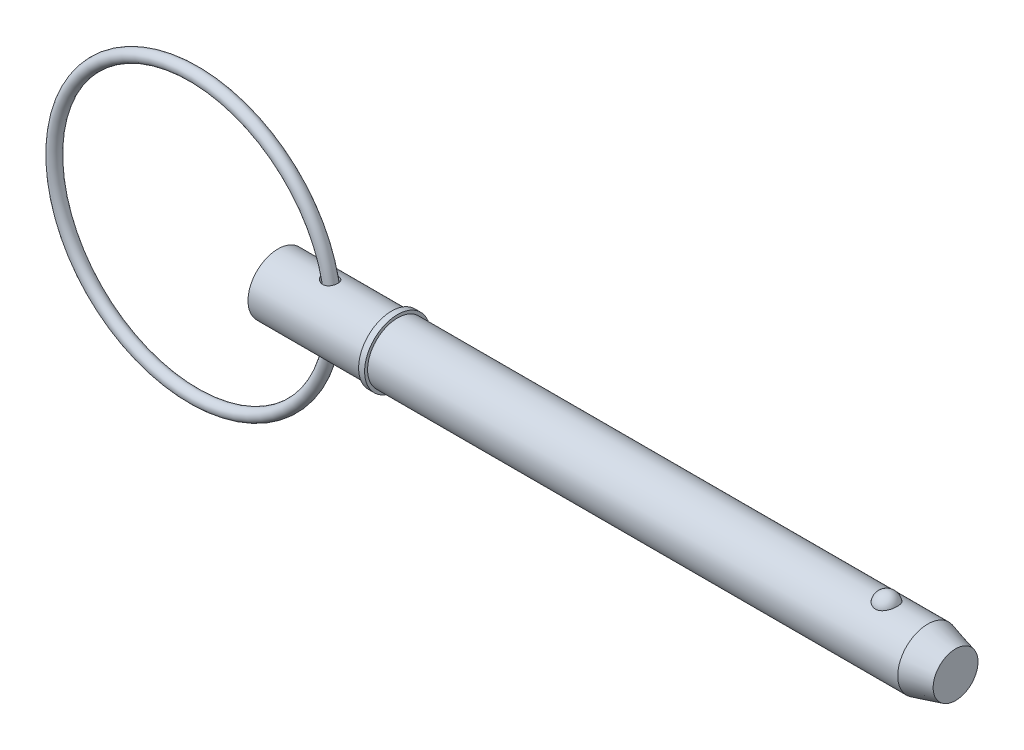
ISO-10303-21;
HEADER;
FILE_DESCRIPTION(('STEP AP214'),'2;1');
FILE_NAME('part.step','',(''),(''),'','','');
FILE_SCHEMA(('AUTOMOTIVE_DESIGN { 1 0 10303 214 1 1 1 1 }'));
ENDSEC;
DATA;
#1=APPLICATION_CONTEXT('core data for automotive mechanical design processes');
#2=APPLICATION_PROTOCOL_DEFINITION('international standard','automotive_design',2000,#1);
#3=PRODUCT_CONTEXT('',#1,'mechanical');
#4=PRODUCT('Part','Part','',(#3));
#5=PRODUCT_RELATED_PRODUCT_CATEGORY('part','',(#4));
#6=PRODUCT_DEFINITION_FORMATION('','',#4);
#7=PRODUCT_DEFINITION_CONTEXT('part definition',#1,'design');
#8=PRODUCT_DEFINITION('design','',#6,#7);
#9=PRODUCT_DEFINITION_SHAPE('','',#8);
#10=(LENGTH_UNIT() NAMED_UNIT(*) SI_UNIT(.MILLI.,.METRE.));
#11=(NAMED_UNIT(*) PLANE_ANGLE_UNIT() SI_UNIT($,.RADIAN.));
#12=(NAMED_UNIT(*) SI_UNIT($,.STERADIAN.) SOLID_ANGLE_UNIT());
#13=UNCERTAINTY_MEASURE_WITH_UNIT(LENGTH_MEASURE(1.E-05),#10,'distance_accuracy_value','');
#14=(GEOMETRIC_REPRESENTATION_CONTEXT(3) GLOBAL_UNCERTAINTY_ASSIGNED_CONTEXT((#13)) GLOBAL_UNIT_ASSIGNED_CONTEXT((#10,
#11,#12)) REPRESENTATION_CONTEXT('',''));
#15=CARTESIAN_POINT('',(0.,0.,0.));
#16=DIRECTION('',(0.,0.,1.));
#17=DIRECTION('',(1.,0.,0.));
#18=AXIS2_PLACEMENT_3D('',#15,#16,#17);
#19=CARTESIAN_POINT('',(-13.4013067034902,0.,0.));
#20=DIRECTION('',(0.,0.,1.));
#21=DIRECTION('',(1.,0.,0.));
#22=AXIS2_PLACEMENT_3D('',#19,#20,#21);
#23=TOROIDAL_SURFACE('',#22,22.225,0.952999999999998);
#24=CARTESIAN_POINT('',(9.77669329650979,0.,0.));
#25=VERTEX_POINT('',#24);
#26=VERTEX_LOOP('',#25);
#27=FACE_BOUND('',#26,.T.);
#28=ADVANCED_FACE('P0_F12',(#27),#23,.T.);
#29=CLOSED_SHELL('',(#28));
#30=MANIFOLD_SOLID_BREP('P0_B1',#29);
#31=CARTESIAN_POINT('',(0.,0.,0.));
#32=DIRECTION('',(1.,0.,0.));
#33=DIRECTION('',(0.,0.,-1.));
#34=AXIS2_PLACEMENT_3D('',#31,#32,#33);
#35=CYLINDRICAL_SURFACE('',#34,4.765);
#36=CARTESIAN_POINT('',(7.48459594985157,4.685973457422,-0.864220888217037));
#37=CARTESIAN_POINT('',(7.53849733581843,4.67711144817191,-0.912273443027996));
#38=CARTESIAN_POINT('',(7.59654891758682,4.66833039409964,-0.955745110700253));
#39=CARTESIAN_POINT('',(7.71924602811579,4.65195567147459,-1.03251233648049));
#40=CARTESIAN_POINT('',(7.78389917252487,4.64436340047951,-1.06579596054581));
#41=CARTESIAN_POINT('',(7.91808098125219,4.63129108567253,-1.12124172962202));
#42=CARTESIAN_POINT('',(7.98761280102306,4.62581242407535,-1.14339659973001));
#43=CARTESIAN_POINT('',(8.12956198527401,4.61771699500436,-1.17566870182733));
#44=CARTESIAN_POINT('',(8.20197774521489,4.61509865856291,-1.18579253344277));
#45=CARTESIAN_POINT('',(8.34550810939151,4.6131791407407,-1.19323853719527));
#46=CARTESIAN_POINT('',(8.41660306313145,4.61378793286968,-1.19090812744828));
#47=CARTESIAN_POINT('',(8.55721866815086,4.61812874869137,-1.17396277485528));
#48=CARTESIAN_POINT('',(8.62673979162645,4.62185982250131,-1.15935156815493));
#49=CARTESIAN_POINT('',(8.75801373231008,4.63172632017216,-1.11925454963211));
#50=CARTESIAN_POINT('',(8.81998342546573,4.63771186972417,-1.09443918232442));
#51=CARTESIAN_POINT('',(8.93863698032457,4.65140179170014,-1.03470792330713));
#52=CARTESIAN_POINT('',(8.99532131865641,4.65910600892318,-0.999792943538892));
#53=CARTESIAN_POINT('',(9.10080884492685,4.67519705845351,-0.921583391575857));
#54=CARTESIAN_POINT('',(9.14973848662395,4.68356861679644,-0.878455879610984));
#55=CARTESIAN_POINT('',(9.23971126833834,4.70019813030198,-0.784620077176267));
#56=CARTESIAN_POINT('',(9.28075401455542,4.7084560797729,-0.733911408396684));
#57=CARTESIAN_POINT('',(9.35441071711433,4.7240688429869,-0.62563775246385));
#58=CARTESIAN_POINT('',(9.38691359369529,4.73141115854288,-0.567995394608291));
#59=CARTESIAN_POINT('',(9.44203216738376,4.74427907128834,-0.447974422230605));
#60=CARTESIAN_POINT('',(9.46464743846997,4.74980459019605,-0.385595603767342));
#61=CARTESIAN_POINT('',(9.49961110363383,4.75848927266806,-0.257248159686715));
#62=CARTESIAN_POINT('',(9.51186382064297,4.76162635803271,-0.191251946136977));
#63=CARTESIAN_POINT('',(9.52545294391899,4.76511165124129,-0.0580729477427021));
#64=CARTESIAN_POINT('',(9.52678936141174,4.76545986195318,0.00910983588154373));
#65=CARTESIAN_POINT('',(9.51851557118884,4.76333054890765,0.142723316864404));
#66=CARTESIAN_POINT('',(9.50891008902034,4.76085424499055,0.209154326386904));
#67=CARTESIAN_POINT('',(9.47899306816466,4.75334441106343,0.339411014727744));
#68=CARTESIAN_POINT('',(9.45868126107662,4.74831081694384,0.403236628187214));
#69=CARTESIAN_POINT('',(9.4078294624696,4.73622777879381,0.526509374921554));
#70=CARTESIAN_POINT('',(9.37728413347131,4.72917728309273,0.585954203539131));
#71=CARTESIAN_POINT('',(9.30671117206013,4.71383320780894,0.698745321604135));
#72=CARTESIAN_POINT('',(9.26668347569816,4.70553961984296,0.752091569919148));
#73=CARTESIAN_POINT('',(9.17821531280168,4.68864637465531,0.851083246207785));
#74=CARTESIAN_POINT('',(9.12978756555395,4.68004719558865,0.896740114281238));
#75=CARTESIAN_POINT('',(9.02575872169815,4.66350833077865,0.97912505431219));
#76=CARTESIAN_POINT('',(8.97015856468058,4.65556855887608,1.01585429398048));
#77=CARTESIAN_POINT('',(8.85409306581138,4.6413534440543,1.0789347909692));
#78=CARTESIAN_POINT('',(8.79369898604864,4.63505812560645,1.10541268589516));
#79=CARTESIAN_POINT('',(8.66918290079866,4.62469916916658,1.1479836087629));
#80=CARTESIAN_POINT('',(8.60506121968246,4.62063533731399,1.1640775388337));
#81=CARTESIAN_POINT('',(8.47537782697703,4.61517348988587,1.18554696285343));
#82=CARTESIAN_POINT('',(8.4098281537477,4.61375835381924,1.19099130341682));
#83=CARTESIAN_POINT('',(8.2786938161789,4.61362908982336,1.19149080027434));
#84=CARTESIAN_POINT('',(8.21310914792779,4.61491539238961,1.18654430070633));
#85=CARTESIAN_POINT('',(8.08152457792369,4.62006017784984,1.16635311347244));
#86=CARTESIAN_POINT('',(8.01557748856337,4.62399895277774,1.15078675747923));
#87=CARTESIAN_POINT('',(7.88704537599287,4.63403793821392,1.10966738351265));
#88=CARTESIAN_POINT('',(7.82446148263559,4.64013886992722,1.08411103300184));
#89=CARTESIAN_POINT('',(7.70057947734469,4.65423592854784,1.02195168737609));
#90=CARTESIAN_POINT('',(7.63957197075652,4.66232221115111,0.984788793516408));
#91=CARTESIAN_POINT('',(7.52457021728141,4.67924552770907,0.900950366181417));
#92=CARTESIAN_POINT('',(7.47057819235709,4.68808279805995,0.854271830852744));
#93=CARTESIAN_POINT('',(7.37028930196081,4.70567913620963,0.751386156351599));
#94=CARTESIAN_POINT('',(7.32416327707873,4.7144333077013,0.695010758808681));
#95=CARTESIAN_POINT('',(7.24276674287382,4.73060166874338,0.574719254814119));
#96=CARTESIAN_POINT('',(7.20749051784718,4.73801656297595,0.510807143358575));
#97=CARTESIAN_POINT('',(7.15148495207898,4.75009927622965,0.381705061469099));
#98=CARTESIAN_POINT('',(7.12994463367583,4.7549169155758,0.31688231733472));
#99=CARTESIAN_POINT('',(7.09904467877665,4.76189692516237,0.184270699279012));
#100=CARTESIAN_POINT('',(7.08967554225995,4.76406136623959,0.116484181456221));
#101=CARTESIAN_POINT('',(7.08394150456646,4.76538257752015,-0.0133529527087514));
#102=CARTESIAN_POINT('',(7.0864533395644,4.76479916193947,-0.0753538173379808));
#103=CARTESIAN_POINT('',(7.10181380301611,4.76127985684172,-0.197993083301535));
#104=CARTESIAN_POINT('',(7.11466291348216,4.75834385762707,-0.258631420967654));
#105=CARTESIAN_POINT('',(7.14973937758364,4.75051877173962,-0.375744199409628));
#106=CARTESIAN_POINT('',(7.17178938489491,4.7456667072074,-0.432274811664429));
#107=CARTESIAN_POINT('',(7.22432962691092,4.73449674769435,-0.54107038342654));
#108=CARTESIAN_POINT('',(7.25481702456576,4.72817934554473,-0.593336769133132));
#109=CARTESIAN_POINT('',(7.31700895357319,4.71588241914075,-0.683642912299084));
#110=CARTESIAN_POINT('',(7.34750058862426,4.7100477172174,-0.722547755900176));
#111=CARTESIAN_POINT('',(7.41288050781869,4.69812059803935,-0.796421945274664));
#112=CARTESIAN_POINT('',(7.44776960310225,4.69202813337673,-0.831390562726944));
#113=CARTESIAN_POINT('',(7.48459594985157,4.685973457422,-0.864220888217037));
#114=B_SPLINE_CURVE_WITH_KNOTS('',3,(#36,#37,#38,#39,#40,#41,#42,#43,#44,#45,#46,#47,#48,#49,
#50,#51,#52,#53,#54,#55,#56,#57,#58,#59,#60,#61,#62,#63,#64,#65,#66,#67,#68,#69,#70,#71,#72,#73,
#74,#75,#76,#77,#78,#79,#80,#81,#82,#83,#84,#85,#86,#87,#88,#89,#90,#91,#92,#93,#94,#95,#96,#97,
#98,#99,#100,#101,#102,#103,#104,#105,#106,#107,#108,#109,#110,#111,#112,#113),.UNSPECIFIED.,
.T.,.F.,(4,2,2,2,2,2,2,2,2,2,2,2,2,2,2,2,2,2,2,2,2,2,2,2,2,2,2,2,2,2,2,2,2,2,2,2,2,2,4),(0.,
0.218078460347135,0.436411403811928,0.654886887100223,0.873242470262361,1.08553925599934,
1.2977714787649,1.49785367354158,1.6979178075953,1.8942789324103,2.09064985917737,
2.28946102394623,2.48828075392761,2.68891673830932,2.88955251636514,3.09010167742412,
3.29065586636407,3.49131482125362,3.69197512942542,3.89233421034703,4.09266707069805,
4.29043955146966,4.48819484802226,4.68466743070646,4.8811713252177,5.08390806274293,
5.28671248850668,5.50140943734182,5.71617422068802,5.93513249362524,6.15397522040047,
6.35827356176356,6.56241234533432,6.74765856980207,6.93291343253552,7.11475139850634,
7.29652829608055,7.44549570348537,7.59449062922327),.UNSPECIFIED.);
#115=CARTESIAN_POINT('',(7.48459594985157,4.685973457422,-0.864220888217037));
#116=VERTEX_POINT('',#115);
#117=EDGE_CURVE('P1_E42',#116,#116,#114,.T.);
#118=ORIENTED_EDGE('',*,*,#117,.T.);
#119=EDGE_LOOP('',(#118));
#120=FACE_BOUND('',#119,.T.);
#121=CARTESIAN_POINT('',(0.,0.,0.));
#122=DIRECTION('',(1.,0.,0.));
#123=DIRECTION('',(0.,0.,-1.));
#124=AXIS2_PLACEMENT_3D('',#121,#122,#123);
#125=CIRCLE('',#124,4.765);
#126=CARTESIAN_POINT('',(0.,0.,-4.765));
#127=VERTEX_POINT('',#126);
#128=EDGE_CURVE('P1_E9',#127,#127,#125,.T.);
#129=ORIENTED_EDGE('',*,*,#128,.T.);
#130=EDGE_LOOP('',(#129));
#131=FACE_BOUND('',#130,.T.);
#132=CARTESIAN_POINT('',(18.097,0.,0.));
#133=DIRECTION('',(1.,0.,0.));
#134=DIRECTION('',(0.,0.,-1.));
#135=AXIS2_PLACEMENT_3D('',#132,#133,#134);
#136=CIRCLE('',#135,4.765);
#137=CARTESIAN_POINT('',(18.097,0.,-4.765));
#138=VERTEX_POINT('',#137);
#139=EDGE_CURVE('P1_E25',#138,#138,#136,.T.);
#140=ORIENTED_EDGE('',*,*,#139,.F.);
#141=EDGE_LOOP('',(#140));
#142=FACE_BOUND('',#141,.T.);
#143=CARTESIAN_POINT('',(7.48459594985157,-4.685973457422,-0.864220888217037));
#144=CARTESIAN_POINT('',(7.43440944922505,-4.6942250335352,-0.819477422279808));
#145=CARTESIAN_POINT('',(7.38778663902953,-4.70255210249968,-0.77073361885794));
#146=CARTESIAN_POINT('',(7.3030968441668,-4.7184989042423,-0.666172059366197));
#147=CARTESIAN_POINT('',(7.26503010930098,-4.72611861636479,-0.610354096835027));
#148=CARTESIAN_POINT('',(7.19878266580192,-4.73983819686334,-0.492624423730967));
#149=CARTESIAN_POINT('',(7.17064194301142,-4.74593188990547,-0.430689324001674));
#150=CARTESIAN_POINT('',(7.12584349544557,-4.75581281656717,-0.3026233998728));
#151=CARTESIAN_POINT('',(7.10917889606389,-4.75960143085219,-0.236495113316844));
#152=CARTESIAN_POINT('',(7.0889853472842,-4.76421379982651,-0.106818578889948));
#153=CARTESIAN_POINT('',(7.0846333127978,-4.76522320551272,-0.0434047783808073));
#154=CARTESIAN_POINT('',(7.08693064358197,-4.7646936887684,0.0832041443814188));
#155=CARTESIAN_POINT('',(7.09357756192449,-4.76315533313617,0.146399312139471));
#156=CARTESIAN_POINT('',(7.11694629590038,-4.75784365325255,0.267709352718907));
#157=CARTESIAN_POINT('',(7.13318365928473,-4.75417793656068,0.325923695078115));
#158=CARTESIAN_POINT('',(7.17459606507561,-4.74508048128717,0.438922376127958));
#159=CARTESIAN_POINT('',(7.19977257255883,-4.73964845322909,0.493706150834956));
#160=CARTESIAN_POINT('',(7.25946789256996,-4.72725615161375,0.60111049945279));
#161=CARTESIAN_POINT('',(7.2943661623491,-4.72023663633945,0.653512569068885));
#162=CARTESIAN_POINT('',(7.37173226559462,-4.70550732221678,0.752279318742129));
#163=CARTESIAN_POINT('',(7.41420315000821,-4.69779724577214,0.798641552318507));
#164=CARTESIAN_POINT('',(7.50982312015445,-4.6816641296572,0.888551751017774));
#165=CARTESIAN_POINT('',(7.56359853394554,-4.67324162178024,0.931434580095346));
#166=CARTESIAN_POINT('',(7.67736628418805,-4.65728554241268,1.00819498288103));
#167=CARTESIAN_POINT('',(7.7373611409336,-4.64975233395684,1.04206888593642));
#168=CARTESIAN_POINT('',(7.86574076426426,-4.63599923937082,1.10169445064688));
#169=CARTESIAN_POINT('',(7.93441048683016,-4.62988111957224,1.12685968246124));
#170=CARTESIAN_POINT('',(8.07519000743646,-4.62035710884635,1.16529928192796));
#171=CARTESIAN_POINT('',(8.14729925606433,-4.61695078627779,1.1785755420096));
#172=CARTESIAN_POINT('',(8.29111621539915,-4.61341807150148,1.19232949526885));
#173=CARTESIAN_POINT('',(8.36279361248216,-4.61321655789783,1.19310032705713));
#174=CARTESIAN_POINT('',(8.50512944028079,-4.61602317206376,1.1821962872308));
#175=CARTESIAN_POINT('',(8.57578827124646,-4.61903000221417,1.17052644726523));
#176=CARTESIAN_POINT('',(8.70965757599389,-4.62766311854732,1.13589249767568));
#177=CARTESIAN_POINT('',(8.77306169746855,-4.63312492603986,1.11363308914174));
#178=CARTESIAN_POINT('',(8.8949702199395,-4.64598463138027,1.05869880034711));
#179=CARTESIAN_POINT('',(8.95347516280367,-4.65338231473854,1.02602507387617));
#180=CARTESIAN_POINT('',(9.06253415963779,-4.66906009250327,0.952097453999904));
#181=CARTESIAN_POINT('',(9.11324728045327,-4.67731427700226,0.911072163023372));
#182=CARTESIAN_POINT('',(9.20707850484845,-4.69393979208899,0.821122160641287));
#183=CARTESIAN_POINT('',(9.25019629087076,-4.70231112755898,0.772197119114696));
#184=CARTESIAN_POINT('',(9.32819072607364,-4.71835356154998,0.667239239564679));
#185=CARTESIAN_POINT('',(9.36297449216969,-4.72601623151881,0.611136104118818));
#186=CARTESIAN_POINT('',(9.42286382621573,-4.73971239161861,0.493799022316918));
#187=CARTESIAN_POINT('',(9.44796891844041,-4.74574580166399,0.432564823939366));
#188=CARTESIAN_POINT('',(9.48811605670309,-4.75559286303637,0.305990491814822));
#189=CARTESIAN_POINT('',(9.50304870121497,-4.75938232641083,0.240613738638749));
#190=CARTESIAN_POINT('',(9.5220569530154,-4.76423188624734,0.108201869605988));
#191=CARTESIAN_POINT('',(9.52613255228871,-4.76529198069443,0.0411667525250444));
#192=CARTESIAN_POINT('',(9.52332772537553,-4.76456884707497,-0.0926701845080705));
#193=CARTESIAN_POINT('',(9.51644541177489,-4.76278512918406,-0.159471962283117));
#194=CARTESIAN_POINT('',(9.49188827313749,-4.75656536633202,-0.290934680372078));
#195=CARTESIAN_POINT('',(9.47421322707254,-4.75212926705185,-0.355595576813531));
#196=CARTESIAN_POINT('',(9.42849503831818,-4.74108318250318,-0.480955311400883));
#197=CARTESIAN_POINT('',(9.4004503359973,-4.73447287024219,-0.541653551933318));
#198=CARTESIAN_POINT('',(9.33467290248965,-4.71979928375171,-0.657361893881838));
#199=CARTESIAN_POINT('',(9.29694000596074,-4.71173598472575,-0.712371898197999));
#200=CARTESIAN_POINT('',(9.2127449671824,-4.69505469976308,-0.815106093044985));
#201=CARTESIAN_POINT('',(9.1662875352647,-4.68643701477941,-0.862834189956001));
#202=CARTESIAN_POINT('',(9.06584125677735,-4.66961864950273,-0.949656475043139));
#203=CARTESIAN_POINT('',(9.01185326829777,-4.66141792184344,-0.98875164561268));
#204=CARTESIAN_POINT('',(8.8985010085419,-4.64646376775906,-1.0567894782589));
#205=CARTESIAN_POINT('',(8.83920621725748,-4.63969468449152,-1.08584444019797));
#206=CARTESIAN_POINT('',(8.71642097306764,-4.62824519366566,-1.13365785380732));
#207=CARTESIAN_POINT('',(8.65293102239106,-4.623564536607,-1.15241753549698));
#208=CARTESIAN_POINT('',(8.52421291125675,-4.61681938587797,-1.17914952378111));
#209=CARTESIAN_POINT('',(8.45900634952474,-4.6147310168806,-1.18722032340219));
#210=CARTESIAN_POINT('',(8.32811210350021,-4.61325848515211,-1.19292878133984));
#211=CARTESIAN_POINT('',(8.26242433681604,-4.61387479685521,-1.19056460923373));
#212=CARTESIAN_POINT('',(8.13057358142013,-4.6177227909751,-1.17555160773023));
#213=CARTESIAN_POINT('',(8.06444352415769,-4.62102282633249,-1.16263394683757));
#214=CARTESIAN_POINT('',(7.93513143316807,-4.62989870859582,-1.12676570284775));
#215=CARTESIAN_POINT('',(7.87194976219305,-4.6354748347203,-1.10381388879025));
#216=CARTESIAN_POINT('',(7.75155849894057,-4.64811746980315,-1.04928030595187));
#217=CARTESIAN_POINT('',(7.69423767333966,-4.65514232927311,-1.01793362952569));
#218=CARTESIAN_POINT('',(7.58503138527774,-4.67007903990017,-0.947046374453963));
#219=CARTESIAN_POINT('',(7.53314612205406,-4.67799092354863,-0.907505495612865));
#220=CARTESIAN_POINT('',(7.48459594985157,-4.685973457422,-0.864220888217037));
#221=B_SPLINE_CURVE_WITH_KNOTS('',3,(#143,#144,#145,#146,#147,#148,#149,#150,#151,#152,#153,
#154,#155,#156,#157,#158,#159,#160,#161,#162,#163,#164,#165,#166,#167,#168,#169,#170,#171,#172,
#173,#174,#175,#176,#177,#178,#179,#180,#181,#182,#183,#184,#185,#186,#187,#188,#189,#190,#191,
#192,#193,#194,#195,#196,#197,#198,#199,#200,#201,#202,#203,#204,#205,#206,#207,#208,#209,#210,
#211,#212,#213,#214,#215,#216,#217,#218,#219,#220),.UNSPECIFIED.,.T.,.F.,(4,2,2,2,2,2,2,2,2,2,2,
2,2,2,2,2,2,2,2,2,2,2,2,2,2,2,2,2,2,2,2,2,2,2,2,2,2,2,4),(0.,0.203013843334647,
0.406033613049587,0.609862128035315,0.813568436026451,1.0032929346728,1.19297523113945,
1.37380897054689,1.55467236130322,1.74393241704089,1.93326889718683,2.14025373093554,
2.3473227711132,2.566425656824,2.78549366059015,2.9994188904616,3.21325763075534,
3.41451842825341,3.61575693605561,3.81208930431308,4.00842987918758,4.20686629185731,
4.40531245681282,4.60586051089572,4.80640871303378,5.0069914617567,5.20757831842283,
5.40819535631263,5.60881581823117,5.80932827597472,6.00981790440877,6.2079863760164,
6.40613116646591,6.60243714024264,6.79877754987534,7.00028133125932,7.20180983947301,
7.39819723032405,7.59459181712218),.UNSPECIFIED.);
#222=CARTESIAN_POINT('',(7.48459594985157,-4.685973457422,-0.864220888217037));
#223=VERTEX_POINT('',#222);
#224=EDGE_CURVE('P1_E17',#223,#223,#221,.T.);
#225=ORIENTED_EDGE('',*,*,#224,.T.);
#226=EDGE_LOOP('',(#225));
#227=FACE_BOUND('',#226,.T.);
#228=ADVANCED_FACE('P1_F13',(#120,#131,#142,#227),#35,.T.);
#229=CARTESIAN_POINT('',(0.,0.,0.));
#230=DIRECTION('',(1.,0.,0.));
#231=DIRECTION('',(0.,0.,-1.));
#232=AXIS2_PLACEMENT_3D('',#229,#230,#231);
#233=CYLINDRICAL_SURFACE('',#232,4.765);
#234=CARTESIAN_POINT('',(103.504194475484,0.,0.));
#235=DIRECTION('',(1.,0.,0.));
#236=DIRECTION('',(0.,0.,-1.));
#237=AXIS2_PLACEMENT_3D('',#234,#235,#236);
#238=CIRCLE('',#237,4.765);
#239=CARTESIAN_POINT('',(103.504194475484,0.,-4.765));
#240=VERTEX_POINT('',#239);
#241=EDGE_CURVE('P1_E99',#240,#240,#238,.T.);
#242=ORIENTED_EDGE('',*,*,#241,.F.);
#243=EDGE_LOOP('',(#242));
#244=FACE_BOUND('',#243,.T.);
#245=CARTESIAN_POINT('',(19.05,0.,0.));
#246=DIRECTION('',(1.,0.,0.));
#247=DIRECTION('',(0.,0.,-1.));
#248=AXIS2_PLACEMENT_3D('',#245,#246,#247);
#249=CIRCLE('',#248,4.765);
#250=CARTESIAN_POINT('',(19.05,0.,-4.765));
#251=VERTEX_POINT('',#250);
#252=EDGE_CURVE('P1_E96',#251,#251,#249,.T.);
#253=ORIENTED_EDGE('',*,*,#252,.T.);
#254=EDGE_LOOP('',(#253));
#255=FACE_BOUND('',#254,.T.);
#256=CARTESIAN_POINT('',(96.951020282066,4.42764777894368,1.76101111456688));
#257=CARTESIAN_POINT('',(96.8597212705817,4.42764470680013,1.76101422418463));
#258=CARTESIAN_POINT('',(96.7684468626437,4.43059091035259,1.75366340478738));
#259=CARTESIAN_POINT('',(96.5886154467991,4.44201846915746,1.72451180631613));
#260=CARTESIAN_POINT('',(96.5000577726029,4.45049845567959,1.70271460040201));
#261=CARTESIAN_POINT('',(96.3282570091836,4.47200516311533,1.6453937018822));
#262=CARTESIAN_POINT('',(96.2450064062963,4.48502527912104,1.60988994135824));
#263=CARTESIAN_POINT('',(96.0857633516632,4.51419542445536,1.52617873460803));
#264=CARTESIAN_POINT('',(96.0097723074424,4.53034605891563,1.47796883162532));
#265=CARTESIAN_POINT('',(95.8647445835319,4.5645931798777,1.36860494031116));
#266=CARTESIAN_POINT('',(95.7959645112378,4.58273170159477,1.30712420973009));
#267=CARTESIAN_POINT('',(95.6693423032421,4.61870302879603,1.1737020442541));
#268=CARTESIAN_POINT('',(95.6115021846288,4.63653577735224,1.1017586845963));
#269=CARTESIAN_POINT('',(95.5055709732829,4.67090140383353,0.945806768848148));
#270=CARTESIAN_POINT('',(95.4580305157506,4.68734068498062,0.861402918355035));
#271=CARTESIAN_POINT('',(95.3770817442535,4.71628466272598,0.685442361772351));
#272=CARTESIAN_POINT('',(95.3436747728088,4.72878898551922,0.593884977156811));
#273=CARTESIAN_POINT('',(95.291287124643,4.74874061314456,0.404781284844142));
#274=CARTESIAN_POINT('',(95.2725178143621,4.75611366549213,0.307168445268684));
#275=CARTESIAN_POINT('',(95.2505846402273,4.76475393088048,0.109940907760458));
#276=CARTESIAN_POINT('',(95.2474205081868,4.76602124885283,0.0103262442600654));
#277=CARTESIAN_POINT('',(95.2567405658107,4.76232928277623,-0.187629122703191));
#278=CARTESIAN_POINT('',(95.2691588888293,4.7573962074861,-0.285973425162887));
#279=CARTESIAN_POINT('',(95.3092804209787,4.74184975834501,-0.479027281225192));
#280=CARTESIAN_POINT('',(95.3369839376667,4.7312362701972,-0.573736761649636));
#281=CARTESIAN_POINT('',(95.4071581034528,4.70540026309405,-0.756973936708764));
#282=CARTESIAN_POINT('',(95.4496460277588,4.69017235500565,-0.845494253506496));
#283=CARTESIAN_POINT('',(95.548520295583,4.6566986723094,-1.01378033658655));
#284=CARTESIAN_POINT('',(95.6049076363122,4.63845268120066,-1.09354547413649));
#285=CARTESIAN_POINT('',(95.730552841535,4.60085438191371,-1.24228523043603));
#286=CARTESIAN_POINT('',(95.7998439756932,4.58149930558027,-1.31123108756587));
#287=CARTESIAN_POINT('',(95.9496066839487,4.54391653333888,-1.43607409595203));
#288=CARTESIAN_POINT('',(96.0300771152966,4.52568872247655,-1.49197257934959));
#289=CARTESIAN_POINT('',(96.1981500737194,4.49293007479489,-1.58786764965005));
#290=CARTESIAN_POINT('',(96.2855445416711,4.47832346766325,-1.62820219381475));
#291=CARTESIAN_POINT('',(96.466553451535,4.45406011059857,-1.69345757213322));
#292=CARTESIAN_POINT('',(96.5601655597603,4.44440151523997,-1.71838415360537));
#293=CARTESIAN_POINT('',(96.7458939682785,4.43159888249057,-1.75112843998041));
#294=CARTESIAN_POINT('',(96.837849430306,4.42815213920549,-1.75974223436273));
#295=CARTESIAN_POINT('',(97.0219658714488,4.427247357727,-1.76201865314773));
#296=CARTESIAN_POINT('',(97.1141268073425,4.42978816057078,-1.7556841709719));
#297=CARTESIAN_POINT('',(97.2931292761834,4.4403864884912,-1.72869560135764));
#298=CARTESIAN_POINT('',(97.3800474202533,4.44827555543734,-1.70847853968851));
#299=CARTESIAN_POINT('',(97.5491314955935,4.46852246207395,-1.65479562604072));
#300=CARTESIAN_POINT('',(97.6312970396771,4.48088066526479,-1.62132869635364));
#301=CARTESIAN_POINT('',(97.7905916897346,4.50907357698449,-1.54120560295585));
#302=CARTESIAN_POINT('',(97.8675700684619,4.52497884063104,-1.49427526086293));
#303=CARTESIAN_POINT('',(98.0127080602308,4.55845148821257,-1.38881222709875));
#304=CARTESIAN_POINT('',(98.0808656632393,4.57601924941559,-1.33027689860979));
#305=CARTESIAN_POINT('',(98.2100990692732,4.61196537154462,-1.19991049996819));
#306=CARTESIAN_POINT('',(98.2706562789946,4.63034074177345,-1.12756415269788));
#307=CARTESIAN_POINT('',(98.3792797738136,4.66513959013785,-0.973612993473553));
#308=CARTESIAN_POINT('',(98.4273438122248,4.68156271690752,-0.892006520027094));
#309=CARTESIAN_POINT('',(98.511383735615,4.71130224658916,-0.718892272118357));
#310=CARTESIAN_POINT('',(98.5469185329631,4.724501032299,-0.627149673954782));
#311=CARTESIAN_POINT('',(98.6029522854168,4.74571823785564,-0.438611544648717));
#312=CARTESIAN_POINT('',(98.623450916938,4.75373654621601,-0.341815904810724));
#313=CARTESIAN_POINT('',(98.6490338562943,4.76378905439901,-0.145633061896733));
#314=CARTESIAN_POINT('',(98.654076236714,4.76580697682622,-0.0462395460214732));
#315=CARTESIAN_POINT('',(98.6485239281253,4.76360573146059,0.15203857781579));
#316=CARTESIAN_POINT('',(98.6379294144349,4.75938663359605,0.250923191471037));
#317=CARTESIAN_POINT('',(98.6013875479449,4.74516937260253,0.445004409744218));
#318=CARTESIAN_POINT('',(98.5754964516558,4.73519238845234,0.540213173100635));
#319=CARTESIAN_POINT('',(98.5089273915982,4.7104939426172,0.7246622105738));
#320=CARTESIAN_POINT('',(98.468248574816,4.69577220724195,0.813902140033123));
#321=CARTESIAN_POINT('',(98.3727177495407,4.66303767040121,0.984313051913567));
#322=CARTESIAN_POINT('',(98.3178042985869,4.64501070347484,1.06544688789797));
#323=CARTESIAN_POINT('',(98.1950496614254,4.60764678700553,1.21692673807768));
#324=CARTESIAN_POINT('',(98.1272086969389,4.58830985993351,1.2872729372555));
#325=CARTESIAN_POINT('',(97.9805480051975,4.55060370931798,1.41479271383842));
#326=CARTESIAN_POINT('',(97.9017918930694,4.53222967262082,1.47203785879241));
#327=CARTESIAN_POINT('',(97.7349890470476,4.49849576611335,1.57212016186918));
#328=CARTESIAN_POINT('',(97.6469417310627,4.48313608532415,1.61495641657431));
#329=CARTESIAN_POINT('',(97.4597918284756,4.45676184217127,1.68642657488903));
#330=CARTESIAN_POINT('',(97.3603653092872,4.44598302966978,1.71430590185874));
#331=CARTESIAN_POINT('',(97.1576210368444,4.43142918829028,1.7515925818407));
#332=CARTESIAN_POINT('',(97.0543049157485,4.42765125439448,1.76100759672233));
#333=CARTESIAN_POINT('',(96.951020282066,4.42764777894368,1.76101111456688));
#334=B_SPLINE_CURVE_WITH_KNOTS('',3,(#256,#257,#258,#259,#260,#261,#262,#263,#264,#265,#266,
#267,#268,#269,#270,#271,#272,#273,#274,#275,#276,#277,#278,#279,#280,#281,#282,#283,#284,#285,
#286,#287,#288,#289,#290,#291,#292,#293,#294,#295,#296,#297,#298,#299,#300,#301,#302,#303,#304,
#305,#306,#307,#308,#309,#310,#311,#312,#313,#314,#315,#316,#317,#318,#319,#320,#321,#322,#323,
#324,#325,#326,#327,#328,#329,#330,#331,#332,#333),.UNSPECIFIED.,.T.,.F.,(4,2,2,2,2,2,2,2,2,2,2,
2,2,2,2,2,2,2,2,2,2,2,2,2,2,2,2,2,2,2,2,2,2,2,2,2,2,2,4),(0.,0.273517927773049,
0.546968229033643,0.820022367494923,1.09312934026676,1.37393946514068,1.65480131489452,
1.94820420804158,2.24163496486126,2.53922817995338,2.8368162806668,3.13315071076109,
3.42949110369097,3.72617893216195,4.02288805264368,4.32037303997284,4.61782764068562,
4.90840095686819,5.19886582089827,5.47474855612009,5.75057789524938,6.01809977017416,
6.28564340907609,6.55907787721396,6.83257454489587,7.11962987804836,7.40673679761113,
7.70312663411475,7.9995228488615,8.29672237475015,8.59391856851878,8.89002850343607,
9.18615552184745,9.483582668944,9.78100471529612,10.0767610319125,10.3725358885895,
10.6820893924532,10.991514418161),.UNSPECIFIED.);
#335=CARTESIAN_POINT('',(96.951020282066,4.42764777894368,1.76101111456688));
#336=VERTEX_POINT('',#335);
#337=EDGE_CURVE('P1_E34',#336,#336,#334,.T.);
#338=ORIENTED_EDGE('',*,*,#337,.T.);
#339=EDGE_LOOP('',(#338));
#340=FACE_BOUND('',#339,.T.);
#341=ADVANCED_FACE('P1_F46',(#244,#255,#340),#233,.T.);
#342=CARTESIAN_POINT('',(0.,0.,0.));
#343=DIRECTION('',(-1.,0.,0.));
#344=DIRECTION('',(0.,0.,1.));
#345=AXIS2_PLACEMENT_3D('',#342,#343,#344);
#346=PLANE('',#345);
#347=ORIENTED_EDGE('',*,*,#128,.F.);
#348=EDGE_LOOP('',(#347));
#349=FACE_BOUND('',#348,.T.);
#350=ADVANCED_FACE('P1_F15',(#349),#346,.T.);
#351=CARTESIAN_POINT('',(18.097,4.765,0.));
#352=DIRECTION('',(-1.,0.,0.));
#353=DIRECTION('',(0.,0.,1.));
#354=AXIS2_PLACEMENT_3D('',#351,#352,#353);
#355=PLANE('',#354);
#356=ORIENTED_EDGE('',*,*,#139,.T.);
#357=EDGE_LOOP('',(#356));
#358=FACE_BOUND('',#357,.T.);
#359=CARTESIAN_POINT('',(18.097,0.,0.));
#360=DIRECTION('',(1.,0.,0.));
#361=DIRECTION('',(0.,0.,-1.));
#362=AXIS2_PLACEMENT_3D('',#359,#360,#361);
#363=CIRCLE('',#362,5.2415);
#364=CARTESIAN_POINT('',(18.097,0.,-5.2415));
#365=VERTEX_POINT('',#364);
#366=EDGE_CURVE('P1_E30',#365,#365,#363,.T.);
#367=ORIENTED_EDGE('',*,*,#366,.F.);
#368=EDGE_LOOP('',(#367));
#369=FACE_BOUND('',#368,.T.);
#370=ADVANCED_FACE('P1_F81',(#358,#369),#355,.T.);
#371=CARTESIAN_POINT('',(0.,0.,0.));
#372=DIRECTION('',(1.,0.,0.));
#373=DIRECTION('',(0.,0.,-1.));
#374=AXIS2_PLACEMENT_3D('',#371,#372,#373);
#375=CYLINDRICAL_SURFACE('',#374,5.2415);
#376=ORIENTED_EDGE('',*,*,#366,.T.);
#377=EDGE_LOOP('',(#376));
#378=FACE_BOUND('',#377,.T.);
#379=CARTESIAN_POINT('',(19.05,0.,0.));
#380=DIRECTION('',(1.,0.,0.));
#381=DIRECTION('',(0.,0.,-1.));
#382=AXIS2_PLACEMENT_3D('',#379,#380,#381);
#383=CIRCLE('',#382,5.2415);
#384=CARTESIAN_POINT('',(19.05,0.,-5.2415));
#385=VERTEX_POINT('',#384);
#386=EDGE_CURVE('P1_E95',#385,#385,#383,.T.);
#387=ORIENTED_EDGE('',*,*,#386,.F.);
#388=EDGE_LOOP('',(#387));
#389=FACE_BOUND('',#388,.T.);
#390=ADVANCED_FACE('P1_F68',(#378,#389),#375,.T.);
#391=CARTESIAN_POINT('',(19.05,5.2415,0.));
#392=DIRECTION('',(1.,0.,0.));
#393=DIRECTION('',(0.,0.,-1.));
#394=AXIS2_PLACEMENT_3D('',#391,#392,#393);
#395=PLANE('',#394);
#396=ORIENTED_EDGE('',*,*,#386,.T.);
#397=EDGE_LOOP('',(#396));
#398=FACE_BOUND('',#397,.T.);
#399=ORIENTED_EDGE('',*,*,#252,.F.);
#400=EDGE_LOOP('',(#399));
#401=FACE_BOUND('',#400,.T.);
#402=ADVANCED_FACE('P1_F62',(#398,#401),#395,.T.);
#403=CARTESIAN_POINT('',(107.95,0.,0.));
#404=DIRECTION('',(-1.,0.,0.));
#405=DIRECTION('',(0.,0.,1.));
#406=AXIS2_PLACEMENT_3D('',#403,#404,#405);
#407=CONICAL_SURFACE('',#406,3.57375000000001,0.26179938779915);
#408=ORIENTED_EDGE('',*,*,#241,.T.);
#409=EDGE_LOOP('',(#408));
#410=FACE_BOUND('',#409,.T.);
#411=CARTESIAN_POINT('',(107.95,0.,0.));
#412=DIRECTION('',(1.,0.,0.));
#413=DIRECTION('',(0.,0.,-1.));
#414=AXIS2_PLACEMENT_3D('',#411,#412,#413);
#415=CIRCLE('',#414,3.57375000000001);
#416=CARTESIAN_POINT('',(107.95,0.,-3.57375000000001));
#417=VERTEX_POINT('',#416);
#418=EDGE_CURVE('P1_E41',#417,#417,#415,.T.);
#419=ORIENTED_EDGE('',*,*,#418,.F.);
#420=EDGE_LOOP('',(#419));
#421=FACE_BOUND('',#420,.T.);
#422=ADVANCED_FACE('P1_F59',(#410,#421),#407,.T.);
#423=CARTESIAN_POINT('',(107.95,3.57375000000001,0.));
#424=DIRECTION('',(1.,0.,0.));
#425=DIRECTION('',(0.,0.,-1.));
#426=AXIS2_PLACEMENT_3D('',#423,#424,#425);
#427=PLANE('',#426);
#428=ORIENTED_EDGE('',*,*,#418,.T.);
#429=EDGE_LOOP('',(#428));
#430=FACE_BOUND('',#429,.T.);
#431=ADVANCED_FACE('P1_F55',(#430),#427,.T.);
#432=CARTESIAN_POINT('',(96.951020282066,4.28849999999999,0.));
#433=DIRECTION('',(-1.,0.,0.));
#434=DIRECTION('',(0.,1.,0.));
#435=AXIS2_PLACEMENT_3D('',#432,#433,#434);
#436=SPHERICAL_SURFACE('',#435,1.7665);
#437=ORIENTED_EDGE('',*,*,#337,.F.);
#438=EDGE_LOOP('',(#437));
#439=FACE_BOUND('',#438,.T.);
#440=ADVANCED_FACE('P1_F50',(#439),#436,.T.);
#441=CARTESIAN_POINT('',(-13.4013067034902,0.,0.));
#442=DIRECTION('',(0.,0.,1.));
#443=DIRECTION('',(1.,0.,0.));
#444=AXIS2_PLACEMENT_3D('',#441,#442,#443);
#445=TOROIDAL_SURFACE('',#444,22.225,1.19125);
#446=ORIENTED_EDGE('',*,*,#224,.F.);
#447=EDGE_LOOP('',(#446));
#448=FACE_BOUND('',#447,.T.);
#449=ORIENTED_EDGE('',*,*,#117,.F.);
#450=EDGE_LOOP('',(#449));
#451=FACE_BOUND('',#450,.T.);
#452=ADVANCED_FACE('P1_F54',(#448,#451),#445,.F.);
#453=CLOSED_SHELL('',(#228,#341,#350,#370,#390,#402,#422,#431,#440,#452));
#454=MANIFOLD_SOLID_BREP('P1_B1',#453);
#455=ADVANCED_BREP_SHAPE_REPRESENTATION('',(#18,#30,#454),#14);
#456=SHAPE_DEFINITION_REPRESENTATION(#9,#455);
ENDSEC;
END-ISO-10303-21;
